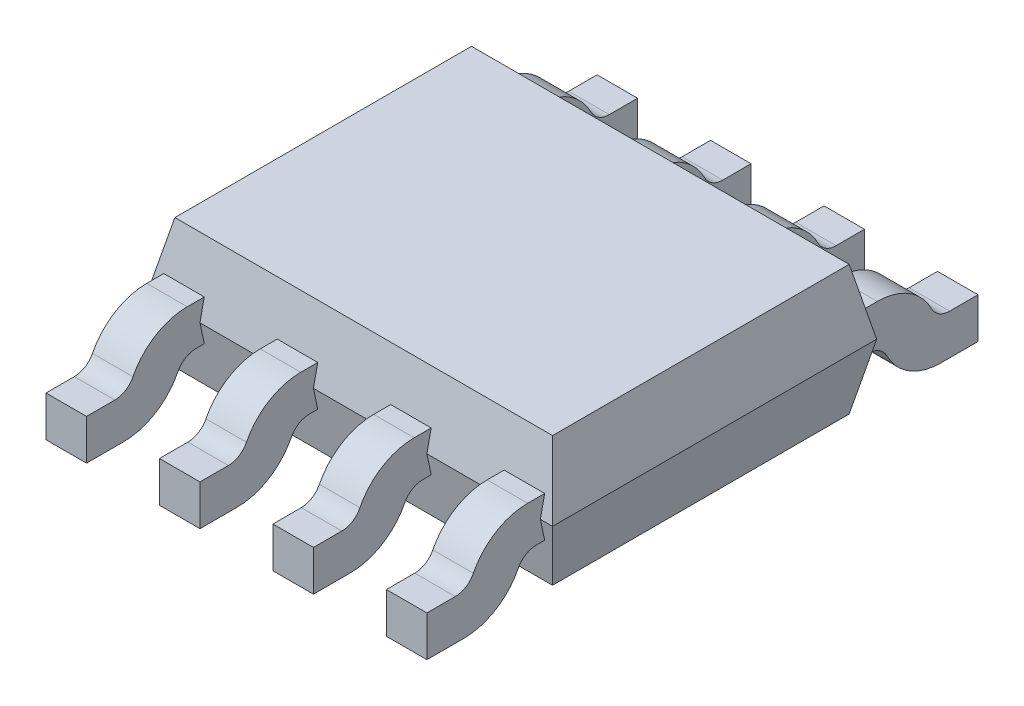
from build123d import *

# Parameters (mm, degrees)
SKETCH1_W                     = 5
SKETCH1_H                     = 4
BOSS_EXTRUDE1_DEPTH           = 0.8
BOSS_EXTRUDE1_TAPER           = 12
BOSS_EXTRUDE1_OTHER_WAY_DEPTH = 0.8
BOSS_EXTRUDE1_OTHER_WAY_TAPER = 12
BOSS_EXTRUDE3_DEPTH           = 0.8
BOSS_EXTRUDE3_DEPTH_BACK      = 1
SKETCH2_W                     = 0.5
SKETCH2_H                     = 0.5
SKETCH3_W                     = 0.5
SKETCH3_H                     = 0.5
BOSS_EXTRUDE4_DEPTH           = 0.55
SKETCH4_W                     = 0.5
SKETCH4_H                     = 0.5
BOSS_EXTRUDE5_DEPTH           = 0.6
FILLET1_R                     = 0.25
FILLET2_R                     = 0.75
LPATTERN2_COUNT               = 4
LPATTERN2_PITCH               = 1.4


with BuildPart() as part:
    # Sketch1 → Boss-Extrude1 (new body)
    with BuildSketch(Plane(origin=(0, 0, 0), x_dir=(1, 0, 0), z_dir=(0, 1, 0))):
        Rectangle(SKETCH1_W, SKETCH1_H)
    extrude(amount=BOSS_EXTRUDE1_DEPTH, taper=BOSS_EXTRUDE1_TAPER)

    # Sketch1 → Boss-Extrude1 other way (add)
    with BuildSketch(Plane(origin=(0, 0, 0), x_dir=(1, 0, 0), z_dir=(0, 1, 0))):
        Rectangle(SKETCH1_W, SKETCH1_H)
    extrude(amount=-BOSS_EXTRUDE1_OTHER_WAY_DEPTH, taper=BOSS_EXTRUDE1_OTHER_WAY_TAPER)


with BuildPart() as body_2:
    # Sketch2 → Boss-Extrude3 (new, two sides: drawn at the far end of the back side and taken through both)
    with BuildSketch(Plane.XY.offset(2).offset(-BOSS_EXTRUDE3_DEPTH_BACK)):
        with Locations((2.1, 0)):
            Rectangle(SKETCH2_W, SKETCH2_H)
    extrude(amount=BOSS_EXTRUDE3_DEPTH + BOSS_EXTRUDE3_DEPTH_BACK)

    # Sketch3 → Boss-Extrude4 (add)
    with BuildSketch(Plane(origin=(0, -0.25, 0), x_dir=(-1, 0, 0), z_dir=(0, -1, 0))):
        with Locations((-2.1, -2.55)):
            Rectangle(SKETCH3_W, SKETCH3_H)
    extrude(amount=BOSS_EXTRUDE4_DEPTH)

    # Sketch4 → Boss-Extrude5 (add)
    with BuildSketch(Plane.XY.offset(2.8)):
        with Locations((2.1, -0.55)):
            Rectangle(SKETCH4_W, SKETCH4_H)
    extrude(amount=BOSS_EXTRUDE5_DEPTH)

    # Fillet1
    fillet1_edges = [body_2.edges().sort_by_distance(p)[0] for p in [
        (2.1, -0.25, 2.3),
        (2.1, -0.3, 2.8),
    ]]
    fillet(fillet1_edges, radius=FILLET1_R)

    # Fillet2
    fillet2_edges = [body_2.edges().sort_by_distance(p)[0] for p in [
        (2.1, -0.8, 2.3),
        (2.1, 0.25, 2.8),
    ]]
    fillet(fillet2_edges, radius=FILLET2_R)


with BuildPart() as lpattern2_1:
    # LPattern2: pattern copy
    add(body_2.part.moved(Location(Vector(-1, 0, 0) * (1 * LPATTERN2_PITCH))))


with BuildPart() as lpattern2_2:
    # LPattern2: pattern copy
    add(body_2.part.moved(Location(Vector(-1, 0, 0) * (2 * LPATTERN2_PITCH))))


with BuildPart() as lpattern2_3:
    # LPattern2: pattern copy
    add(body_2.part.moved(Location(Vector(-1, 0, 0) * (3 * LPATTERN2_PITCH))))


with BuildPart() as body_6:
    # Mirror2: mirrored copy
    add(body_2.part.mirror(Plane.XY))


with BuildPart() as body_7:
    # Mirror2 2: mirrored copy
    add(lpattern2_1.part.mirror(Plane.XY))


with BuildPart() as body_8:
    # Mirror2 3: mirrored copy
    add(lpattern2_2.part.mirror(Plane.XY))


with BuildPart() as body_9:
    # Mirror2 4: mirrored copy
    add(lpattern2_3.part.mirror(Plane.XY))


solid = Compound([part.part, body_2.part, lpattern2_1.part, lpattern2_2.part, lpattern2_3.part, body_6.part, body_7.part, body_8.part, body_9.part])
